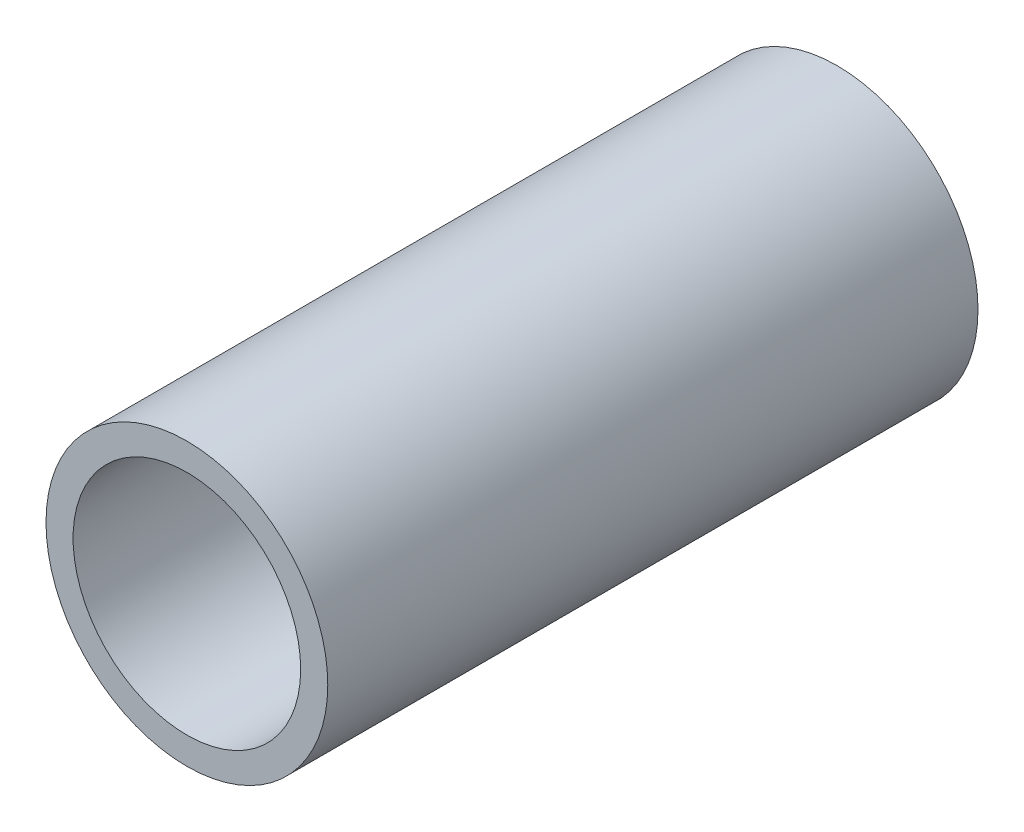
ISO-10303-21;
HEADER;
FILE_DESCRIPTION(('STEP AP214'),'2;1');
FILE_NAME('part.step','',(''),(''),'','','');
FILE_SCHEMA(('AUTOMOTIVE_DESIGN { 1 0 10303 214 1 1 1 1 }'));
ENDSEC;
DATA;
#1=APPLICATION_CONTEXT('core data for automotive mechanical design processes');
#2=APPLICATION_PROTOCOL_DEFINITION('international standard','automotive_design',2000,#1);
#3=PRODUCT_CONTEXT('',#1,'mechanical');
#4=PRODUCT('Part','Part','',(#3));
#5=PRODUCT_RELATED_PRODUCT_CATEGORY('part','',(#4));
#6=PRODUCT_DEFINITION_FORMATION('','',#4);
#7=PRODUCT_DEFINITION_CONTEXT('part definition',#1,'design');
#8=PRODUCT_DEFINITION('design','',#6,#7);
#9=PRODUCT_DEFINITION_SHAPE('','',#8);
#10=(LENGTH_UNIT() NAMED_UNIT(*) SI_UNIT(.MILLI.,.METRE.));
#11=(NAMED_UNIT(*) PLANE_ANGLE_UNIT() SI_UNIT($,.RADIAN.));
#12=(NAMED_UNIT(*) SI_UNIT($,.STERADIAN.) SOLID_ANGLE_UNIT());
#13=UNCERTAINTY_MEASURE_WITH_UNIT(LENGTH_MEASURE(1.E-05),#10,'distance_accuracy_value','');
#14=(GEOMETRIC_REPRESENTATION_CONTEXT(3) GLOBAL_UNCERTAINTY_ASSIGNED_CONTEXT((#13)) GLOBAL_UNIT_ASSIGNED_CONTEXT((#10,
#11,#12)) REPRESENTATION_CONTEXT('',''));
#15=CARTESIAN_POINT('',(0.,0.,0.));
#16=DIRECTION('',(0.,0.,1.));
#17=DIRECTION('',(1.,0.,0.));
#18=AXIS2_PLACEMENT_3D('',#15,#16,#17);
#19=CARTESIAN_POINT('',(0.,0.,60.));
#20=DIRECTION('',(0.,0.,1.));
#21=DIRECTION('',(1.,0.,0.));
#22=AXIS2_PLACEMENT_3D('',#19,#20,#21);
#23=PLANE('',#22);
#24=CARTESIAN_POINT('',(0.,0.,60.));
#25=DIRECTION('',(0.,0.,1.));
#26=DIRECTION('',(1.,0.,0.));
#27=AXIS2_PLACEMENT_3D('',#24,#25,#26);
#28=CIRCLE('',#27,13.);
#29=CARTESIAN_POINT('',(13.,0.,60.));
#30=VERTEX_POINT('',#29);
#31=EDGE_CURVE('E10',#30,#30,#28,.T.);
#32=ORIENTED_EDGE('',*,*,#31,.T.);
#33=EDGE_LOOP('',(#32));
#34=FACE_BOUND('',#33,.T.);
#35=CARTESIAN_POINT('',(0.,0.,60.));
#36=DIRECTION('',(0.,0.,1.));
#37=DIRECTION('',(1.,0.,0.));
#38=AXIS2_PLACEMENT_3D('',#35,#36,#37);
#39=CIRCLE('',#38,10.5);
#40=CARTESIAN_POINT('',(10.5,0.,60.));
#41=VERTEX_POINT('',#40);
#42=EDGE_CURVE('E56',#41,#41,#39,.T.);
#43=ORIENTED_EDGE('',*,*,#42,.F.);
#44=EDGE_LOOP('',(#43));
#45=FACE_BOUND('',#44,.T.);
#46=ADVANCED_FACE('F37',(#34,#45),#23,.T.);
#47=CARTESIAN_POINT('',(0.,0.,0.));
#48=DIRECTION('',(0.,0.,1.));
#49=DIRECTION('',(1.,0.,0.));
#50=AXIS2_PLACEMENT_3D('',#47,#48,#49);
#51=PLANE('',#50);
#52=CARTESIAN_POINT('',(0.,0.,0.));
#53=DIRECTION('',(0.,0.,1.));
#54=DIRECTION('',(1.,0.,0.));
#55=AXIS2_PLACEMENT_3D('',#52,#53,#54);
#56=CIRCLE('',#55,13.);
#57=CARTESIAN_POINT('',(13.,0.,0.));
#58=VERTEX_POINT('',#57);
#59=EDGE_CURVE('E51',#58,#58,#56,.T.);
#60=ORIENTED_EDGE('',*,*,#59,.F.);
#61=EDGE_LOOP('',(#60));
#62=FACE_BOUND('',#61,.T.);
#63=CARTESIAN_POINT('',(0.,0.,0.));
#64=DIRECTION('',(0.,0.,1.));
#65=DIRECTION('',(1.,0.,0.));
#66=AXIS2_PLACEMENT_3D('',#63,#64,#65);
#67=CIRCLE('',#66,10.5);
#68=CARTESIAN_POINT('',(10.5,0.,0.));
#69=VERTEX_POINT('',#68);
#70=EDGE_CURVE('E58',#69,#69,#67,.T.);
#71=ORIENTED_EDGE('',*,*,#70,.T.);
#72=EDGE_LOOP('',(#71));
#73=FACE_BOUND('',#72,.T.);
#74=ADVANCED_FACE('F79',(#62,#73),#51,.F.);
#75=CARTESIAN_POINT('',(0.,0.,60.));
#76=DIRECTION('',(0.,0.,-1.));
#77=DIRECTION('',(-1.,0.,0.));
#78=AXIS2_PLACEMENT_3D('',#75,#76,#77);
#79=CYLINDRICAL_SURFACE('',#78,13.);
#80=CARTESIAN_POINT('',(0.,-13.,30.5));
#81=CARTESIAN_POINT('',(0.147170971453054,-12.9999991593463,30.4999989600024));
#82=CARTESIAN_POINT('',(0.294388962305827,-12.9974940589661,30.4940849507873));
#83=CARTESIAN_POINT('',(0.587774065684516,-12.9875360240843,30.4704847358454));
#84=CARTESIAN_POINT('',(0.73394047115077,-12.9800800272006,30.4527912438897));
#85=CARTESIAN_POINT('',(1.024371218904,-12.9603968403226,30.4057694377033));
#86=CARTESIAN_POINT('',(1.16863112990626,-12.9481600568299,30.3764177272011));
#87=CARTESIAN_POINT('',(1.45396745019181,-12.9192320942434,30.3063710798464));
#88=CARTESIAN_POINT('',(1.5950425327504,-12.9025390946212,30.2656715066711));
#89=CARTESIAN_POINT('',(1.87247674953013,-12.8651986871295,30.1735004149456));
#90=CARTESIAN_POINT('',(2.00885202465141,-12.8445668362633,30.1220712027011));
#91=CARTESIAN_POINT('',(2.27663482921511,-12.799820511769,30.0088025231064));
#92=CARTESIAN_POINT('',(2.40804047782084,-12.7757047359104,29.9469591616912));
#93=CARTESIAN_POINT('',(2.79344958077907,-12.6990159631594,29.7466091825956));
#94=CARTESIAN_POINT('',(3.03901208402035,-12.6420498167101,29.5931597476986));
#95=CARTESIAN_POINT('',(3.51286477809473,-12.5188932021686,29.2427391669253));
#96=CARTESIAN_POINT('',(3.73980031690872,-12.4523949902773,29.0440611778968));
#97=CARTESIAN_POINT('',(4.1584158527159,-12.3189227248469,28.6121899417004));
#98=CARTESIAN_POINT('',(4.35007674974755,-12.251948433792,28.378978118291));
#99=CARTESIAN_POINT('',(4.61187121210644,-12.1548322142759,28.0009719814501));
#100=CARTESIAN_POINT('',(4.69655632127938,-12.1222751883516,27.8666445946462));
#101=CARTESIAN_POINT('',(4.85422991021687,-12.0600010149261,27.590688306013));
#102=CARTESIAN_POINT('',(4.92722324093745,-12.0302826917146,27.4490624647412));
#103=CARTESIAN_POINT('',(5.06088165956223,-11.9746701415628,27.1593820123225));
#104=CARTESIAN_POINT('',(5.12154632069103,-11.9487760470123,27.0113271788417));
#105=CARTESIAN_POINT('',(5.22990674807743,-11.9017463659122,26.7098849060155));
#106=CARTESIAN_POINT('',(5.27760925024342,-11.8806083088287,26.5565002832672));
#107=CARTESIAN_POINT('',(5.35752952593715,-11.8447753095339,26.2531054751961));
#108=CARTESIAN_POINT('',(5.39038899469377,-11.829816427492,26.1032955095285));
#109=CARTESIAN_POINT('',(5.4435101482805,-11.8054671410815,25.8010756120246));
#110=CARTESIAN_POINT('',(5.46377770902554,-11.7960741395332,25.6486669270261));
#111=CARTESIAN_POINT('',(5.49147800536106,-11.7832043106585,25.3424800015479));
#112=CARTESIAN_POINT('',(5.49891430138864,-11.7797258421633,25.1887021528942));
#113=CARTESIAN_POINT('',(5.50086453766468,-11.7788154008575,24.8810509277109));
#114=CARTESIAN_POINT('',(5.49537919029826,-11.781383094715,24.7271775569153));
#115=CARTESIAN_POINT('',(5.47251333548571,-11.7920200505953,24.4328919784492));
#116=CARTESIAN_POINT('',(5.45611702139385,-11.799633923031,24.2923854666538));
#117=CARTESIAN_POINT('',(5.41261970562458,-11.8196497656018,24.0133412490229));
#118=CARTESIAN_POINT('',(5.38551521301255,-11.8320532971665,23.8748042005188));
#119=CARTESIAN_POINT('',(5.3208785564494,-11.8612607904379,23.6006894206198));
#120=CARTESIAN_POINT('',(5.2833487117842,-11.8780637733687,23.4651110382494));
#121=CARTESIAN_POINT('',(5.19821193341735,-11.9155674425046,23.1976915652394));
#122=CARTESIAN_POINT('',(5.15060110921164,-11.9362696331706,23.065851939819));
#123=CARTESIAN_POINT('',(4.99098780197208,-12.0043186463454,22.6716074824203));
#124=CARTESIAN_POINT('',(4.86355220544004,-12.0569662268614,22.4161715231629));
#125=CARTESIAN_POINT('',(4.57190089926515,-12.1705434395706,21.929429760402));
#126=CARTESIAN_POINT('',(4.40767043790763,-12.2314763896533,21.6981336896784));
#127=CARTESIAN_POINT('',(4.03024784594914,-12.361242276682,21.2448031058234));
#128=CARTESIAN_POINT('',(3.81403120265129,-12.4303002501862,21.0253443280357));
#129=CARTESIAN_POINT('',(3.34703565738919,-12.5640815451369,20.6248579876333));
#130=CARTESIAN_POINT('',(3.09624817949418,-12.6288037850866,20.4438399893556));
#131=CARTESIAN_POINT('',(2.69550491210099,-12.7182445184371,20.2031855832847));
#132=CARTESIAN_POINT('',(2.55594585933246,-12.7470910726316,20.1273769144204));
#133=CARTESIAN_POINT('',(2.27022448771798,-12.801061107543,19.987883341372));
#134=CARTESIAN_POINT('',(2.12406488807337,-12.8261861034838,19.9241935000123));
#135=CARTESIAN_POINT('',(1.82619315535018,-12.8719745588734,19.8095773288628));
#136=CARTESIAN_POINT('',(1.67448238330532,-12.8926391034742,19.7586478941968));
#137=CARTESIAN_POINT('',(1.36663490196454,-12.9288946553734,19.6700889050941));
#138=CARTESIAN_POINT('',(1.21049854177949,-12.9444860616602,19.6324583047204));
#139=CARTESIAN_POINT('',(0.905320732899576,-12.9692827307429,19.5729404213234));
#140=CARTESIAN_POINT('',(0.756475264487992,-12.9788363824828,19.5501908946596));
#141=CARTESIAN_POINT('',(0.457184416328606,-12.9928218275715,19.5169672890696));
#142=CARTESIAN_POINT('',(0.306739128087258,-12.9972539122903,19.5064925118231));
#143=CARTESIAN_POINT('',(0.00547197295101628,-13.0008714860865,19.4979390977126));
#144=CARTESIAN_POINT('',(-0.145349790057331,-13.0000582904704,19.4998573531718));
#145=CARTESIAN_POINT('',(-0.446205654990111,-12.9932112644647,19.5160604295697));
#146=CARTESIAN_POINT('',(-0.596239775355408,-12.9871775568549,19.5303449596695));
#147=CARTESIAN_POINT('',(-0.886619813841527,-12.9705031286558,19.5700592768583));
#148=CARTESIAN_POINT('',(-1.02706513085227,-12.9601171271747,19.5948736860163));
#149=CARTESIAN_POINT('',(-1.30528413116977,-12.9350590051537,19.6552357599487));
#150=CARTESIAN_POINT('',(-1.44305693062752,-12.9203854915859,19.6907869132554));
#151=CARTESIAN_POINT('',(-1.71496663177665,-12.8871112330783,19.7722834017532));
#152=CARTESIAN_POINT('',(-1.84910455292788,-12.8685116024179,19.8182257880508));
#153=CARTESIAN_POINT('',(-2.11299935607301,-12.8278253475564,19.9201109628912));
#154=CARTESIAN_POINT('',(-2.24275454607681,-12.8057373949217,19.9760575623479));
#155=CARTESIAN_POINT('',(-2.63214717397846,-12.7335250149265,20.1620180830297));
#156=CARTESIAN_POINT('',(-2.8836248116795,-12.678505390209,20.3076688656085));
#157=CARTESIAN_POINT('',(-3.35934310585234,-12.5608557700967,20.6355462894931));
#158=CARTESIAN_POINT('',(-3.5835721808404,-12.4982225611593,20.8177883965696));
#159=CARTESIAN_POINT('',(-4.01593856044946,-12.3663644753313,21.2293578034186));
#160=CARTESIAN_POINT('',(-4.22167824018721,-12.2969936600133,21.4611628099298));
#161=CARTESIAN_POINT('',(-4.59209307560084,-12.1635344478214,21.9572389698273));
#162=CARTESIAN_POINT('',(-4.75675780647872,-12.0994473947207,22.221518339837));
#163=CARTESIAN_POINT('',(-4.97029142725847,-12.0125863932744,22.6396337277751));
#164=CARTESIAN_POINT('',(-5.03630554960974,-11.9849839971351,22.7839425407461));
#165=CARTESIAN_POINT('',(-5.1558215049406,-11.9340574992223,23.0783592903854));
#166=CARTESIAN_POINT('',(-5.20932879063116,-11.9107315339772,23.2284646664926));
#167=CARTESIAN_POINT('',(-5.30323608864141,-11.8692175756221,23.5333290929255));
#168=CARTESIAN_POINT('',(-5.34364252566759,-11.8510270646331,23.6880858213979));
#169=CARTESIAN_POINT('',(-5.4108942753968,-11.8204734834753,24.0010835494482));
#170=CARTESIAN_POINT('',(-5.43774092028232,-11.8081098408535,24.1593242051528));
#171=CARTESIAN_POINT('',(-5.47594717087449,-11.7904370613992,24.4653315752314));
#172=CARTESIAN_POINT('',(-5.4883614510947,-11.7846483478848,24.6129397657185));
#173=CARTESIAN_POINT('',(-5.50123612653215,-11.7786439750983,24.9087872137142));
#174=CARTESIAN_POINT('',(-5.50169715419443,-11.7784280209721,25.0570264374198));
#175=CARTESIAN_POINT('',(-5.49066064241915,-11.7835767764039,25.3529370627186));
#176=CARTESIAN_POINT('',(-5.47916489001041,-11.7889406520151,25.5006085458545));
#177=CARTESIAN_POINT('',(-5.44435758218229,-11.8050555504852,25.7942492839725));
#178=CARTESIAN_POINT('',(-5.42104613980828,-11.8158065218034,25.9402185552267));
#179=CARTESIAN_POINT('',(-5.36432004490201,-11.8416633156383,26.2221714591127));
#180=CARTESIAN_POINT('',(-5.33146595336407,-11.8565257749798,26.3582905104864));
#181=CARTESIAN_POINT('',(-5.25564793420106,-11.8903270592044,26.6271775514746));
#182=CARTESIAN_POINT('',(-5.21268074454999,-11.9092671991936,26.7599444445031));
#183=CARTESIAN_POINT('',(-5.06914365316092,-11.9714126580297,27.1519988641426));
#184=CARTESIAN_POINT('',(-4.95389867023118,-12.0199620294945,27.4052343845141));
#185=CARTESIAN_POINT('',(-4.67962846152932,-12.1294732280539,27.9047054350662));
#186=CARTESIAN_POINT('',(-4.5183572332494,-12.1910124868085,28.1495662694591));
#187=CARTESIAN_POINT('',(-4.15951932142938,-12.3180564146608,28.6102013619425));
#188=CARTESIAN_POINT('',(-3.96193943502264,-12.3835625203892,28.8259649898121));
#189=CARTESIAN_POINT('',(-3.63355835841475,-12.4824564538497,29.1318257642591));
#190=CARTESIAN_POINT('',(-3.51400691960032,-12.5167183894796,29.2339723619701));
#191=CARTESIAN_POINT('',(-3.26632865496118,-12.5836212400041,29.4278432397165));
#192=CARTESIAN_POINT('',(-3.13820493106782,-12.6162627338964,29.5195712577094));
#193=CARTESIAN_POINT('',(-2.87400185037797,-12.6790603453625,29.6920176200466));
#194=CARTESIAN_POINT('',(-2.73791520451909,-12.7092141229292,29.7727256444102));
#195=CARTESIAN_POINT('',(-2.45879702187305,-12.7661500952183,29.9223340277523));
#196=CARTESIAN_POINT('',(-2.31576872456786,-12.7929338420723,29.991239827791));
#197=CARTESIAN_POINT('',(-2.02587157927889,-12.842006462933,30.1156966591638));
#198=CARTESIAN_POINT('',(-1.87909262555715,-12.8643567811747,30.1714326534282));
#199=CARTESIAN_POINT('',(-1.58079245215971,-12.904407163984,30.2702719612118));
#200=CARTESIAN_POINT('',(-1.42927352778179,-12.9221094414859,30.313381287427));
#201=CARTESIAN_POINT('',(-1.1229885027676,-12.9523172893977,30.3864298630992));
#202=CARTESIAN_POINT('',(-0.968231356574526,-12.9648355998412,30.4164014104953));
#203=CARTESIAN_POINT('',(-0.656450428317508,-12.9843533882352,30.4629556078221));
#204=CARTESIAN_POINT('',(-0.499428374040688,-12.9913568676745,30.4795479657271));
#205=CARTESIAN_POINT('',(-0.285055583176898,-12.9969994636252,30.4929045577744));
#206=CARTESIAN_POINT('',(-0.228085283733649,-12.9981240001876,30.4955645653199));
#207=CARTESIAN_POINT('',(-0.114079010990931,-12.9996244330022,30.4991124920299));
#208=CARTESIAN_POINT('',(-0.0570430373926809,-13.0000003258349,30.5000004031));
#209=CARTESIAN_POINT('',(0.,-13.,30.5));
#210=B_SPLINE_CURVE_WITH_KNOTS('',3,(#80,#81,#82,#83,#84,#85,#86,#87,#88,#89,#90,#91,#92,#93,
#94,#95,#96,#97,#98,#99,#100,#101,#102,#103,#104,#105,#106,#107,#108,#109,#110,#111,#112,#113,
#114,#115,#116,#117,#118,#119,#120,#121,#122,#123,#124,#125,#126,#127,#128,#129,#130,#131,#132,
#133,#134,#135,#136,#137,#138,#139,#140,#141,#142,#143,#144,#145,#146,#147,#148,#149,#150,#151,
#152,#153,#154,#155,#156,#157,#158,#159,#160,#161,#162,#163,#164,#165,#166,#167,#168,#169,#170,
#171,#172,#173,#174,#175,#176,#177,#178,#179,#180,#181,#182,#183,#184,#185,#186,#187,#188,#189,
#190,#191,#192,#193,#194,#195,#196,#197,#198,#199,#200,#201,#202,#203,#204,#205,#206,#207,#208,
#209),.UNSPECIFIED.,.T.,.F.,(4,2,2,2,2,2,2,2,2,2,2,2,2,2,2,2,2,2,2,2,2,2,2,2,2,2,2,2,2,2,2,2,2,
2,2,2,2,2,2,2,2,2,2,2,2,2,2,2,2,2,2,2,2,2,2,2,2,2,2,2,2,2,2,2,4),(0.,0.441455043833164,
0.883183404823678,1.32580276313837,1.76860322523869,2.20968967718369,2.6509414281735,
3.53228747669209,4.45506565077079,5.37834201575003,5.86412651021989,6.3497089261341,
6.83530814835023,7.32065453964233,7.78233210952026,8.24379407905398,8.70512798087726,
9.16643644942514,9.59093146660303,10.0155649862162,10.4401041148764,10.8648073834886,
11.7316714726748,12.5988837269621,13.5418809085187,14.4851124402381,14.968840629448,
15.4523713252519,15.9357842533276,16.4191591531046,16.8712073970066,17.3232299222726,
17.7751391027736,18.2270376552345,18.6555377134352,19.084177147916,19.5126950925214,
19.9413766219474,20.8245846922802,21.7081668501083,22.6567560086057,23.6055856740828,
24.0882718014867,24.5707470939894,25.0529854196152,25.5351763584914,25.9793278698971,
26.4234558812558,26.8675175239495,27.3115749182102,27.7335322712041,28.1556259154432,
28.9992225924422,29.8943989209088,30.7899014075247,31.2722293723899,31.7543837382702,
32.2369865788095,32.7193663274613,33.1945041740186,33.6694153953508,34.1431524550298,
34.6165454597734,34.7876513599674,34.9587580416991),.UNSPECIFIED.);
#211=CARTESIAN_POINT('',(0.,-13.,30.5));
#212=VERTEX_POINT('',#211);
#213=EDGE_CURVE('E61',#212,#212,#210,.T.);
#214=ORIENTED_EDGE('',*,*,#213,.T.);
#215=EDGE_LOOP('',(#214));
#216=FACE_BOUND('',#215,.T.);
#217=ORIENTED_EDGE('',*,*,#31,.F.);
#218=EDGE_LOOP('',(#217));
#219=FACE_BOUND('',#218,.T.);
#220=ORIENTED_EDGE('',*,*,#59,.T.);
#221=EDGE_LOOP('',(#220));
#222=FACE_BOUND('',#221,.T.);
#223=ADVANCED_FACE('F39',(#216,#219,#222),#79,.T.);
#224=CARTESIAN_POINT('',(0.,0.,60.));
#225=DIRECTION('',(0.,0.,-1.));
#226=DIRECTION('',(-1.,0.,0.));
#227=AXIS2_PLACEMENT_3D('',#224,#225,#226);
#228=CYLINDRICAL_SURFACE('',#227,10.5);
#229=CARTESIAN_POINT('',(0.,-10.5,30.5));
#230=CARTESIAN_POINT('',(0.143796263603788,-10.5000001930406,30.5000002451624));
#231=CARTESIAN_POINT('',(0.287589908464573,-10.4970396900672,30.494354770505));
#232=CARTESIAN_POINT('',(0.574107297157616,-10.4852737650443,30.4718422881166));
#233=CARTESIAN_POINT('',(0.716830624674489,-10.4764661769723,30.4549711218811));
#234=CARTESIAN_POINT('',(1.00024169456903,-10.4532175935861,30.4101870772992));
#235=CARTESIAN_POINT('',(1.14092676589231,-10.4387697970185,30.3822608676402));
#236=CARTESIAN_POINT('',(1.41913501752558,-10.4046004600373,30.3156867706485));
#237=CARTESIAN_POINT('',(1.55665688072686,-10.3848767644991,30.2770345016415));
#238=CARTESIAN_POINT('',(1.82698100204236,-10.3407352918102,30.1896266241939));
#239=CARTESIAN_POINT('',(1.95980158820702,-10.3163388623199,30.1409168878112));
#240=CARTESIAN_POINT('',(2.22061357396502,-10.2633630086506,30.0337638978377));
#241=CARTESIAN_POINT('',(2.34860312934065,-10.2347820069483,29.9753169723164));
#242=CARTESIAN_POINT('',(2.72415688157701,-10.1437234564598,29.7861692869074));
#243=CARTESIAN_POINT('',(2.96358681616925,-10.0758825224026,29.6415698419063));
#244=CARTESIAN_POINT('',(3.43066701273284,-9.92696152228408,29.309064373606));
#245=CARTESIAN_POINT('',(3.65656059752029,-9.84530968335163,29.1189661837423));
#246=CARTESIAN_POINT('',(4.07491346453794,-9.67965661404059,28.7056302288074));
#247=CARTESIAN_POINT('',(4.26734458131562,-9.59565347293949,28.4823648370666));
#248=CARTESIAN_POINT('',(4.63024047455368,-9.42626188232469,27.9855255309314));
#249=CARTESIAN_POINT('',(4.79732813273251,-9.34139100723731,27.7092627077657));
#250=CARTESIAN_POINT('',(5.01073024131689,-9.22762727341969,27.2735053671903));
#251=CARTESIAN_POINT('',(5.07567463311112,-9.19195360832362,27.1246398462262));
#252=CARTESIAN_POINT('',(5.19246692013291,-9.12648707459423,26.8206445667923));
#253=CARTESIAN_POINT('',(5.24432290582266,-9.09669057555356,26.6655187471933));
#254=CARTESIAN_POINT('',(5.33147196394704,-9.04587187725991,26.3598180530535));
#255=CARTESIAN_POINT('',(5.36758592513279,-9.02442355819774,26.2095477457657));
#256=CARTESIAN_POINT('',(5.42711505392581,-8.98875025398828,25.9057372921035));
#257=CARTESIAN_POINT('',(5.45053729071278,-8.97452124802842,25.7521990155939));
#258=CARTESIAN_POINT('',(5.4843074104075,-8.95392462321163,25.44328054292));
#259=CARTESIAN_POINT('',(5.49466512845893,-8.94755109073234,25.2879018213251));
#260=CARTESIAN_POINT('',(5.50215163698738,-8.94294977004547,24.9767130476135));
#261=CARTESIAN_POINT('',(5.49928192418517,-8.9447210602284,24.8209030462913));
#262=CARTESIAN_POINT('',(5.48164962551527,-8.95553447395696,24.5313480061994));
#263=CARTESIAN_POINT('',(5.4685424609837,-8.96356423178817,24.3974600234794));
#264=CARTESIAN_POINT('',(5.43264157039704,-8.98536851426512,24.1314224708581));
#265=CARTESIAN_POINT('',(5.40984484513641,-8.999144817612,23.9992734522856));
#266=CARTESIAN_POINT('',(5.35483827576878,-9.03198374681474,23.7376319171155));
#267=CARTESIAN_POINT('',(5.32262912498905,-9.05104598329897,23.6081392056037));
#268=CARTESIAN_POINT('',(5.24914689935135,-9.09385830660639,23.3525267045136));
#269=CARTESIAN_POINT('',(5.20787023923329,-9.11761024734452,23.2264082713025));
#270=CARTESIAN_POINT('',(5.06895262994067,-9.19604427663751,22.8485602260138));
#271=CARTESIAN_POINT('',(4.95744503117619,-9.25713638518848,22.6031016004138));
#272=CARTESIAN_POINT('',(4.70145397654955,-9.38973117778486,22.1332808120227));
#273=CARTESIAN_POINT('',(4.55695578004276,-9.4612385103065,21.9089281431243));
#274=CARTESIAN_POINT('',(4.21538213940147,-9.61876927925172,21.4542439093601));
#275=CARTESIAN_POINT('',(4.01376635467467,-9.70541798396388,21.2275283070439));
#276=CARTESIAN_POINT('',(3.57506967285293,-9.87542897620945,20.8094592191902));
#277=CARTESIAN_POINT('',(3.33796868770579,-9.95878936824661,20.6181259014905));
#278=CARTESIAN_POINT('',(2.95227601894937,-10.0773817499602,20.3567193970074));
#279=CARTESIAN_POINT('',(2.81467266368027,-10.1167719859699,20.2720121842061));
#280=CARTESIAN_POINT('',(2.53166900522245,-10.1912715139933,20.1146309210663));
#281=CARTESIAN_POINT('',(2.38627204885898,-10.2263826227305,20.0419517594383));
#282=CARTESIAN_POINT('',(2.08868203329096,-10.2912874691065,19.9094271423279));
#283=CARTESIAN_POINT('',(1.93649208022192,-10.3210836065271,19.849575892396));
#284=CARTESIAN_POINT('',(1.6264032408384,-10.3744660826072,19.7434179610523));
#285=CARTESIAN_POINT('',(1.46850508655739,-10.3980532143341,19.6971095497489));
#286=CARTESIAN_POINT('',(1.16243764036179,-10.4364935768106,19.6221437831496));
#287=CARTESIAN_POINT('',(1.01463356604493,-10.4519323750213,19.5922924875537));
#288=CARTESIAN_POINT('',(0.71656984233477,-10.476587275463,19.5447919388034));
#289=CARTESIAN_POINT('',(0.566310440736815,-10.4858040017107,19.5271414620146));
#290=CARTESIAN_POINT('',(0.264656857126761,-10.497748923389,19.5042901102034));
#291=CARTESIAN_POINT('',(0.11326320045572,-10.5004799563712,19.4990837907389));
#292=CARTESIAN_POINT('',(-0.189409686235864,-10.4993819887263,19.5011797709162));
#293=CARTESIAN_POINT('',(-0.340688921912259,-10.4955533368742,19.5084814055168));
#294=CARTESIAN_POINT('',(-0.628695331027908,-10.4820648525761,19.5343078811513));
#295=CARTESIAN_POINT('',(-0.765541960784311,-10.4729421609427,19.5517994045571));
#296=CARTESIAN_POINT('',(-1.03714797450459,-10.4495411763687,19.5969191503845));
#297=CARTESIAN_POINT('',(-1.17190668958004,-10.4352612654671,19.6245505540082));
#298=CARTESIAN_POINT('',(-1.4383741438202,-10.4018794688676,19.689644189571));
#299=CARTESIAN_POINT('',(-1.57008381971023,-10.3827790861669,19.7271033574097));
#300=CARTESIAN_POINT('',(-1.82972720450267,-10.34018607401,19.811477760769));
#301=CARTESIAN_POINT('',(-1.95765944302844,-10.3166917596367,19.8583966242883));
#302=CARTESIAN_POINT('',(-2.34116942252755,-10.2390375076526,20.0153846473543));
#303=CARTESIAN_POINT('',(-2.58969338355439,-10.1785859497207,20.1400244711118));
#304=CARTESIAN_POINT('',(-3.06292097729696,-10.0463479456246,20.4234533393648));
#305=CARTESIAN_POINT('',(-3.28761496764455,-9.97455694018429,20.5822561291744));
#306=CARTESIAN_POINT('',(-3.73205379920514,-9.8174816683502,20.9486779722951));
#307=CARTESIAN_POINT('',(-3.94879719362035,-9.73157224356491,21.1596732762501));
#308=CARTESIAN_POINT('',(-4.34536512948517,-9.56109142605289,21.6148944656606));
#309=CARTESIAN_POINT('',(-4.52515796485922,-9.4765212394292,21.8591485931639));
#310=CARTESIAN_POINT('',(-4.76868413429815,-9.35513758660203,22.2548802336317));
#311=CARTESIAN_POINT('',(-4.84732754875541,-9.31451299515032,22.3962099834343));
#312=CARTESIAN_POINT('',(-4.99224647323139,-9.23765084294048,22.6861906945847));
#313=CARTESIAN_POINT('',(-5.05852757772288,-9.20141130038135,22.8348383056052));
#314=CARTESIAN_POINT('',(-5.17794700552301,-9.13474391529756,23.1384275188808));
#315=CARTESIAN_POINT('',(-5.23109704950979,-9.1043108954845,23.2933633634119));
#316=CARTESIAN_POINT('',(-5.32359636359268,-9.05053548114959,23.6085005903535));
#317=CARTESIAN_POINT('',(-5.36294800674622,-9.02719186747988,23.7687010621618));
#318=CARTESIAN_POINT('',(-5.42406160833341,-8.99058927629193,24.0770742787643));
#319=CARTESIAN_POINT('',(-5.44716763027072,-8.97656719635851,24.2248906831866));
#320=CARTESIAN_POINT('',(-5.48127022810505,-8.95578474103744,24.5224138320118));
#321=CARTESIAN_POINT('',(-5.49226836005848,-8.94902343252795,24.6721203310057));
#322=CARTESIAN_POINT('',(-5.50197361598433,-8.94305982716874,24.9720097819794));
#323=CARTESIAN_POINT('',(-5.50068664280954,-8.9438539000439,25.1221924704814));
#324=CARTESIAN_POINT('',(-5.4858581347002,-8.95295681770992,25.4217136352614));
#325=CARTESIAN_POINT('',(-5.47231730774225,-8.96126522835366,25.5710521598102));
#326=CARTESIAN_POINT('',(-5.4354360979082,-8.98367623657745,25.8506390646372));
#327=CARTESIAN_POINT('',(-5.41338939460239,-8.99700999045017,25.9811222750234));
#328=CARTESIAN_POINT('',(-5.36012032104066,-9.02884611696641,26.2395732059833));
#329=CARTESIAN_POINT('',(-5.32889516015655,-9.04735006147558,26.3675401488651));
#330=CARTESIAN_POINT('',(-5.22192679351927,-9.10979553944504,26.7465025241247));
#331=CARTESIAN_POINT('',(-5.13286824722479,-9.16068520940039,26.9927261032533));
#332=CARTESIAN_POINT('',(-4.91542354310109,-9.27926813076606,27.4830016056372));
#333=CARTESIAN_POINT('',(-4.78483904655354,-9.34784532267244,27.7258493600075));
#334=CARTESIAN_POINT('',(-4.49031583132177,-9.49284208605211,28.1878214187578));
#335=CARTESIAN_POINT('',(-4.32635918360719,-9.56926586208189,28.4069328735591));
#336=CARTESIAN_POINT('',(-3.94317511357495,-9.73398461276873,28.8467685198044));
#337=CARTESIAN_POINT('',(-3.71944418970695,-9.82246375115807,29.0635511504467));
#338=CARTESIAN_POINT('',(-3.3577362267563,-9.94947567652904,29.3588917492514));
#339=CARTESIAN_POINT('',(-3.23269550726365,-9.9908951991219,29.4524343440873));
#340=CARTESIAN_POINT('',(-2.97448028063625,-10.0707839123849,29.6289184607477));
#341=CARTESIAN_POINT('',(-2.84130944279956,-10.1092544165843,29.7118647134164));
#342=CARTESIAN_POINT('',(-2.56486842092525,-10.1829423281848,29.867970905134));
#343=CARTESIAN_POINT('',(-2.42145220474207,-10.2180819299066,29.9409091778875));
#344=CARTESIAN_POINT('',(-2.12786454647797,-10.2832282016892,30.0742651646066));
#345=CARTESIAN_POINT('',(-1.97769647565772,-10.3132373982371,30.1346890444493));
#346=CARTESIAN_POINT('',(-1.6719577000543,-10.3671887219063,30.2422095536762));
#347=CARTESIAN_POINT('',(-1.51639890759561,-10.3911433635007,30.2893336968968));
#348=CARTESIAN_POINT('',(-1.20095114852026,-10.4323051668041,30.3697473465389));
#349=CARTESIAN_POINT('',(-1.04106471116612,-10.4495161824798,30.4030447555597));
#350=CARTESIAN_POINT('',(-0.73469159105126,-10.4752766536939,30.4526892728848));
#351=CARTESIAN_POINT('',(-0.588484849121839,-10.4845259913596,30.4704099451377));
#352=CARTESIAN_POINT('',(-0.294851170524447,-10.4968876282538,30.4940653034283));
#353=CARTESIAN_POINT('',(-0.147424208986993,-10.4999998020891,30.4999997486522));
#354=CARTESIAN_POINT('',(0.,-10.5,30.5));
#355=B_SPLINE_CURVE_WITH_KNOTS('',3,(#229,#230,#231,#232,#233,#234,#235,#236,#237,#238,#239,
#240,#241,#242,#243,#244,#245,#246,#247,#248,#249,#250,#251,#252,#253,#254,#255,#256,#257,#258,
#259,#260,#261,#262,#263,#264,#265,#266,#267,#268,#269,#270,#271,#272,#273,#274,#275,#276,#277,
#278,#279,#280,#281,#282,#283,#284,#285,#286,#287,#288,#289,#290,#291,#292,#293,#294,#295,#296,
#297,#298,#299,#300,#301,#302,#303,#304,#305,#306,#307,#308,#309,#310,#311,#312,#313,#314,#315,
#316,#317,#318,#319,#320,#321,#322,#323,#324,#325,#326,#327,#328,#329,#330,#331,#332,#333,#334,
#335,#336,#337,#338,#339,#340,#341,#342,#343,#344,#345,#346,#347,#348,#349,#350,#351,#352,#353,
#354),.UNSPECIFIED.,.T.,.F.,(4,2,2,2,2,2,2,2,2,2,2,2,2,2,2,2,2,2,2,2,2,2,2,2,2,2,2,2,2,2,2,2,2,
2,2,2,2,2,2,2,2,2,2,2,2,2,2,2,2,2,2,2,2,2,2,2,2,2,2,2,2,2,4),(0.,0.43124403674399,
0.862647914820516,1.29457361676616,1.72667602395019,2.15684950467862,2.58718557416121,
3.44697058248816,4.36222784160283,5.27825178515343,6.27412724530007,6.77239332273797,
7.27035064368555,7.73776166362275,8.20491207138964,8.67171059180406,9.13845629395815,
9.54228038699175,9.94622956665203,10.3501489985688,10.7542284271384,11.5800142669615,
12.4061698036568,13.3487935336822,14.2919529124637,14.7903427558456,15.2885202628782,
15.7864722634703,16.2843606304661,16.7384736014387,17.1925410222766,17.6464097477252,
18.1002543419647,18.5145551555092,18.9289860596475,19.3432879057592,19.7577489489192,
20.6075006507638,21.4575948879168,22.397022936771,23.3372537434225,23.8369745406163,
24.3364686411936,24.8355152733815,25.3344760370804,25.7846291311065,26.2347243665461,
26.6846033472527,27.1344563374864,27.5330067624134,27.9316784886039,28.7285215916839,
29.5776865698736,30.4273089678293,31.394054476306,31.8782654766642,32.3622595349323,
32.8556651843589,33.3488271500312,33.8409612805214,34.3328137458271,34.7749289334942,
35.2170531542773),.UNSPECIFIED.);
#356=CARTESIAN_POINT('',(0.,-10.5,30.5));
#357=VERTEX_POINT('',#356);
#358=EDGE_CURVE('E42',#357,#357,#355,.T.);
#359=ORIENTED_EDGE('',*,*,#358,.F.);
#360=EDGE_LOOP('',(#359));
#361=FACE_BOUND('',#360,.T.);
#362=ORIENTED_EDGE('',*,*,#42,.T.);
#363=EDGE_LOOP('',(#362));
#364=FACE_BOUND('',#363,.T.);
#365=ORIENTED_EDGE('',*,*,#70,.F.);
#366=EDGE_LOOP('',(#365));
#367=FACE_BOUND('',#366,.T.);
#368=ADVANCED_FACE('F71',(#361,#364,#367),#228,.F.);
#369=CARTESIAN_POINT('',(0.,-60.,25.));
#370=DIRECTION('',(0.,1.,0.));
#371=DIRECTION('',(0.,0.,1.));
#372=AXIS2_PLACEMENT_3D('',#369,#370,#371);
#373=CYLINDRICAL_SURFACE('',#372,5.5);
#374=ORIENTED_EDGE('',*,*,#358,.T.);
#375=EDGE_LOOP('',(#374));
#376=FACE_BOUND('',#375,.T.);
#377=ORIENTED_EDGE('',*,*,#213,.F.);
#378=EDGE_LOOP('',(#377));
#379=FACE_BOUND('',#378,.T.);
#380=ADVANCED_FACE('F68',(#376,#379),#373,.F.);
#381=CLOSED_SHELL('',(#46,#74,#223,#368,#380));
#382=MANIFOLD_SOLID_BREP('B2',#381);
#383=ADVANCED_BREP_SHAPE_REPRESENTATION('',(#18,#382),#14);
#384=SHAPE_DEFINITION_REPRESENTATION(#9,#383);
ENDSEC;
END-ISO-10303-21;
